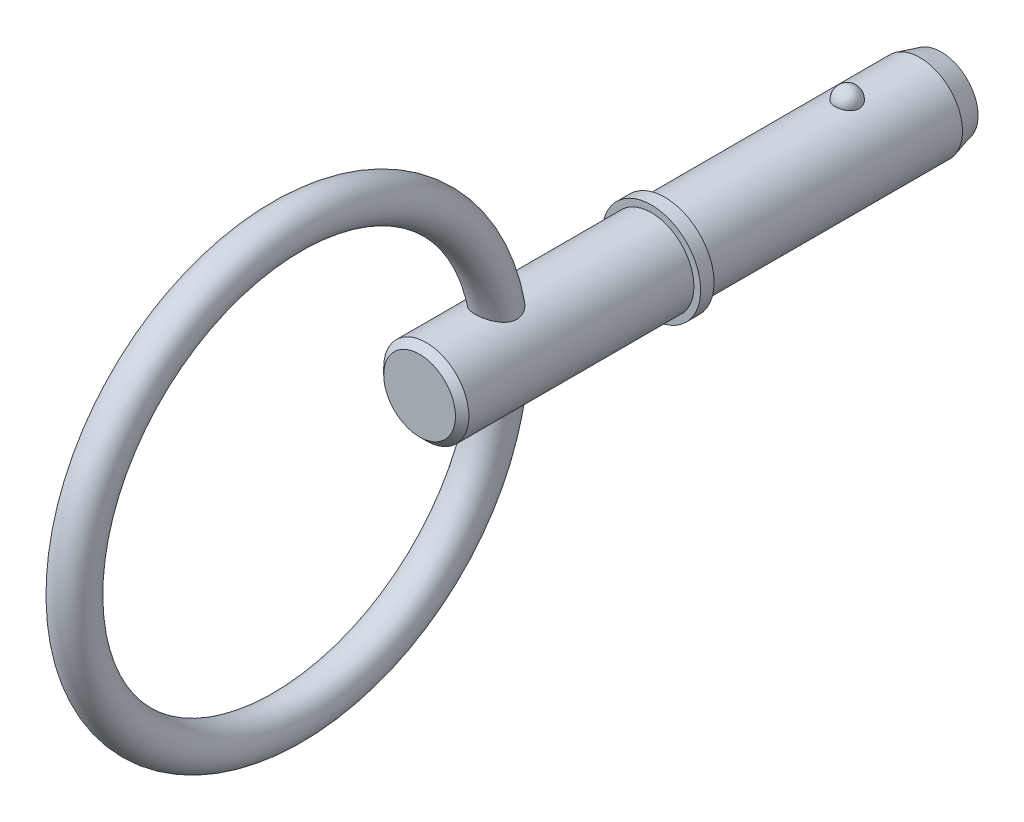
from build123d import *

# Parameters (mm, degrees)
SKETCH2_R           = 3.175
BOSS_EXTRUDE1_DEPTH = 12.7
BOSS_EXTRUDE2_START = 7.92
SKETCH3_R           = 3.175
BOSS_EXTRUDE2_DEPTH = 7.92
CHAMFER1_SIZE       = 1.586
CHAMFER1_SIZE2      = 0.424967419
SKETCH20_W          = 1
SKETCH20_H          = 3.675
SKETCH21_R          = 3.175
BOSS_EXTRUDE3_DEPTH = 18.29
CHAMFER2_SIZE       = 0.5
SKETCH24_R          = 1.5


with BuildPart() as part:
    # Sketch2 → Boss-Extrude1 (new body)
    with BuildSketch(Plane.XY):
        Circle(SKETCH2_R)
    extrude(amount=BOSS_EXTRUDE1_DEPTH)

    # Sketch3 → Boss-Extrude2 (add)
    with BuildSketch(Plane(origin=(0, 0, 0), x_dir=(-1, 0, 0), z_dir=(0, 0, -1)).offset(BOSS_EXTRUDE2_START)):
        Circle(SKETCH3_R)
    extrude(amount=-BOSS_EXTRUDE2_DEPTH)

    # Chamfer1
    chamfer1_edges = [part.edges().sort_by_distance(p)[0] for p in [
        (3.175, 0, -7.92),
    ]]
    chamfer1_side = [part.faces().sort_by_distance(p)[0] for p in [
        (3.175, 0, -3.96),
    ]]
    chamfer(chamfer1_edges, length=CHAMFER1_SIZE, length2=CHAMFER1_SIZE2, reference=chamfer1_side[0])

    # Sketch18 → Revolve1 (revolve)
    with BuildSketch(Plane(origin=(0, 0, 0), x_dir=(0, 0, -1), z_dir=(1, 0, 0))):
        with BuildLine():
            Line((0.91, 4.085), (0.91, 2.265))
            ThreePointArc((0.91, 2.265), (0, 3.175), (0.91, 4.085))
        make_face()
    revolve(axis=Axis((0, 4.085, -0.91), (0, -1, 0)))

    # Sketch20 → Revolve2 (revolve)
    with BuildSketch(Plane(origin=(0, 0, 0), x_dir=(0, 0, -1), z_dir=(1, 0, 0)), mode=Mode.PRIVATE) as revolve2_sk:
        with Locations((-13.2, 1.8375)):
            Rectangle(SKETCH20_W, SKETCH20_H)
    revolve(revolve2_sk.sketch.rotate(Axis((0, 0, 33.728787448), (0, 0, 1)), 90), axis=Axis((0, 0, 33.728787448), (0, 0, 1)))

    # Sketch21 → Boss-Extrude3 (add)
    with BuildSketch(Plane(origin=(0, 0, 12.7), x_dir=(-1, 0, 0), z_dir=(0, 0, -1))):
        Circle(SKETCH21_R)
    extrude(amount=-BOSS_EXTRUDE3_DEPTH)

    # Chamfer2
    chamfer2_edges = [part.edges().sort_by_distance(p)[0] for p in [
        (3.175, 0, 30.99),
    ]]
    chamfer(chamfer2_edges, length=CHAMFER2_SIZE)

    # Sweep1: sweep along a path in Sketch23
    with BuildLine(Plane(origin=(0, 0, 0), x_dir=(0, 0, -1), z_dir=(1, 0, 0))) as sweep1_path:
        CenterArc((-40.865, 0), 15.875, 0, 360)
    # Sketch24 → Sweep1 (sweep)
    with BuildSketch(Plane(origin=(0, 0, 0), x_dir=(1, 0, 0), z_dir=(0, 1, 0))):
        with Locations((0, -24.99)):
            Circle(SKETCH24_R)
    sweep(path=sweep1_path.line)


solid = part.part
